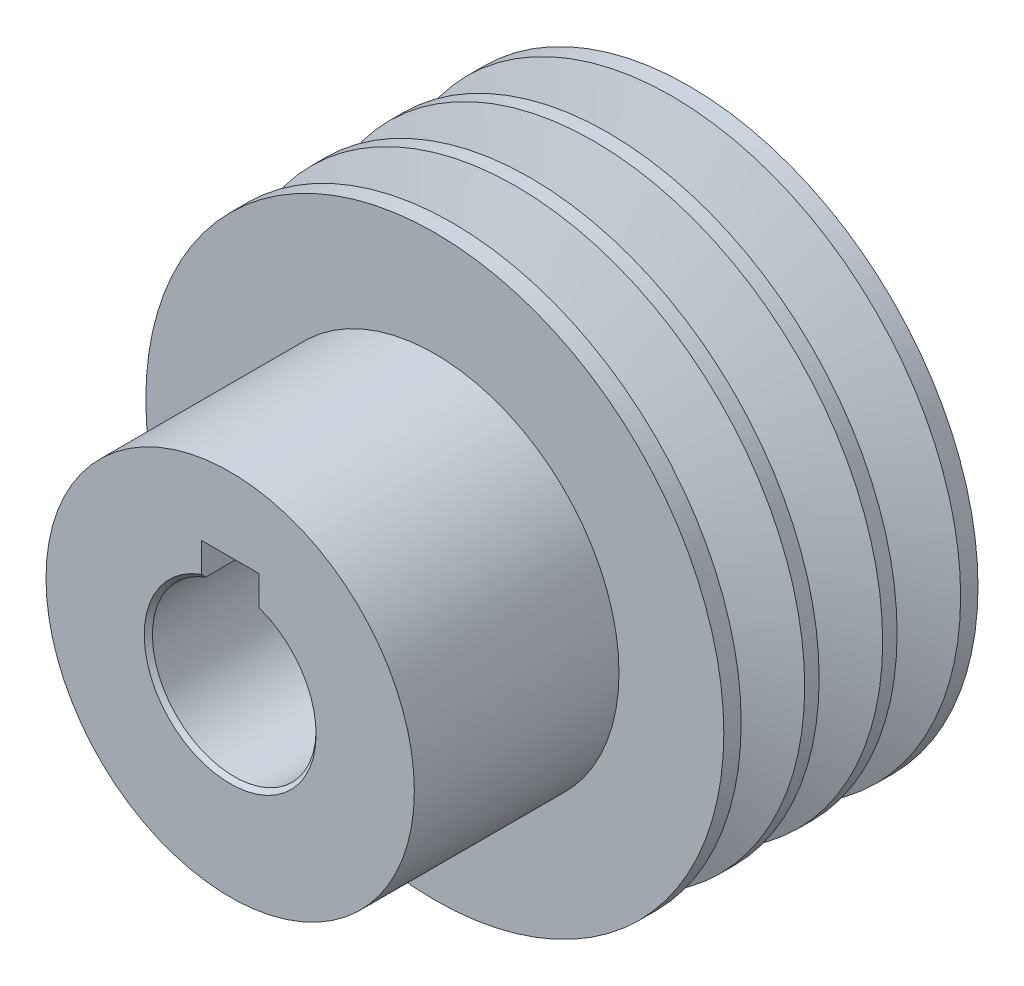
from build123d import *

# Parameters (mm, degrees)
SKETCH2_R          = 45
EXTRUDE1_DEPTH     = 50
CUT_EXTRUDE1_DEPTH = 151.130580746
CHAMFER1_SIZE      = 1


with BuildPart() as part:
    # Sketch1 → A Pulley_ 127.0000mm P.D._ Deep Groove (revolve)
    with BuildSketch(Plane(origin=(0, 0, 0), x_dir=(0, 0, -1), z_dir=(1, 0, 0)), mode=Mode.PRIVATE) as a_pulley_127_0000mm_p_d_deep_groove_sk:
        Polygon((12.00150013, 0), (12.00150013, 70.611999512), (7.759699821, 70.611999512), (2.118580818, 54.229000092), (-2.118580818, 54.229000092), (-7.759699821, 70.611999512), (-11.290299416, 70.611999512), (-16.931418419, 54.229000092), (-21.168580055, 54.229000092), (-26.809699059, 70.611999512), (-30.340298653, 70.611999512), (-35.981417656, 54.229000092), (-40.218579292, 54.229000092), (-45.859698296, 70.611999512), (-50.101498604, 70.611999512), (-50.101498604, 0), align=None)
    revolve(a_pulley_127_0000mm_p_d_deep_groove_sk.sketch.rotate(Axis((0, 0, 62.102998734), (0, 0, -1)), 90), axis=Axis((0, 0, 62.102998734), (0, 0, -1)))

    # Sketch2 → Extrude1 (add)
    with BuildSketch(Plane.XY.offset(50.101498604)):
        with Locations(Location((0, 0, 0), (0, 0, 180))):
            Circle(SKETCH2_R)
    extrude(amount=EXTRUDE1_DEPTH)

    # Sketch3 → Cut-Extrude1 (cut, through all)
    with BuildSketch(Plane.XY.offset(100.101498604)):
        with BuildLine():
            Line((7, 18.734993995), (7, 27))
            Line((7, 27), (-7, 27))
            Line((-7, 27), (-7, 18.734993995))
            ThreePointArc((-7, 18.734993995), (0, -20), (7, 18.734993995))
        make_face()
    extrude(amount=-CUT_EXTRUDE1_DEPTH, mode=Mode.SUBTRACT)

    # Chamfer1
    chamfer1_edges = [part.edges().sort_by_distance(p)[0] for p in [
        (0, -20, -12.00150013),
        (0, -20, 100.101498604),
    ]]
    chamfer(chamfer1_edges, length=CHAMFER1_SIZE)


solid = part.part
